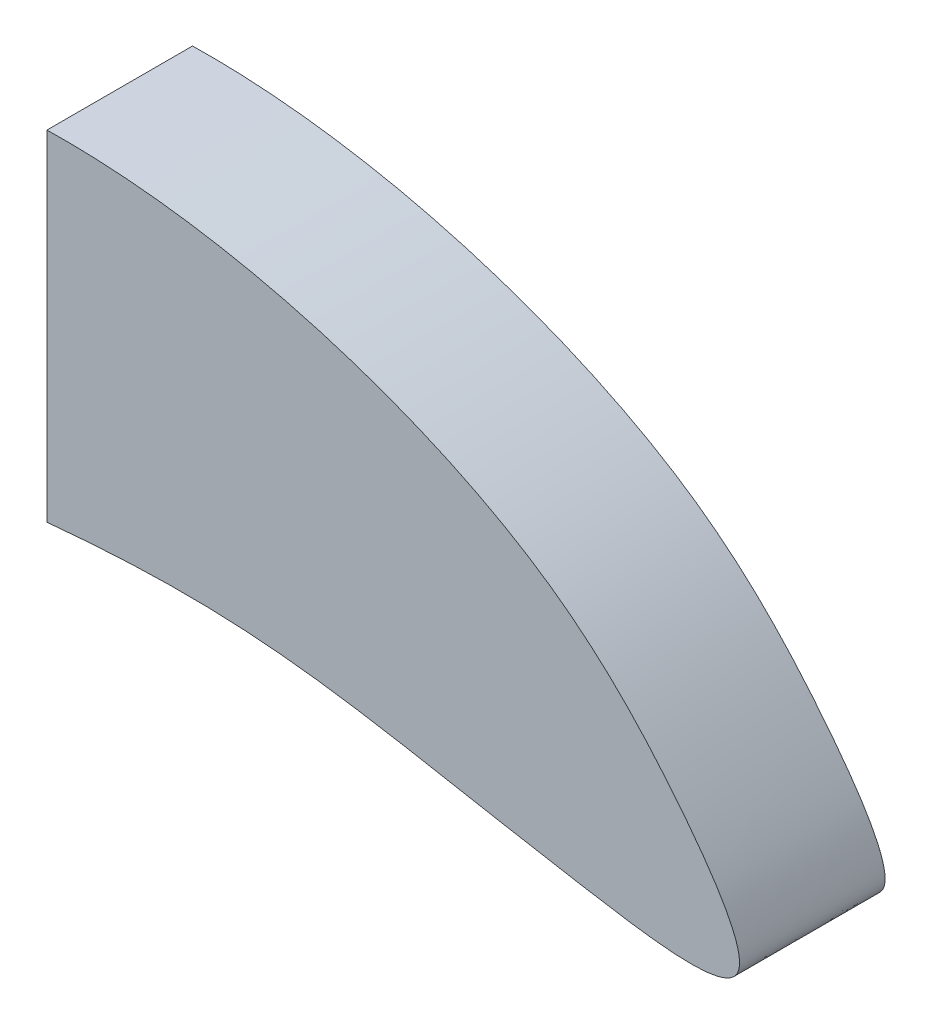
ISO-10303-21;
HEADER;
FILE_DESCRIPTION(('STEP AP214'),'2;1');
FILE_NAME('part.step','',(''),(''),'','','');
FILE_SCHEMA(('AUTOMOTIVE_DESIGN { 1 0 10303 214 1 1 1 1 }'));
ENDSEC;
DATA;
#1=APPLICATION_CONTEXT('core data for automotive mechanical design processes');
#2=APPLICATION_PROTOCOL_DEFINITION('international standard','automotive_design',2000,#1);
#3=PRODUCT_CONTEXT('',#1,'mechanical');
#4=PRODUCT('Part','Part','',(#3));
#5=PRODUCT_RELATED_PRODUCT_CATEGORY('part','',(#4));
#6=PRODUCT_DEFINITION_FORMATION('','',#4);
#7=PRODUCT_DEFINITION_CONTEXT('part definition',#1,'design');
#8=PRODUCT_DEFINITION('design','',#6,#7);
#9=PRODUCT_DEFINITION_SHAPE('','',#8);
#10=(LENGTH_UNIT() NAMED_UNIT(*) SI_UNIT(.MILLI.,.METRE.));
#11=(NAMED_UNIT(*) PLANE_ANGLE_UNIT() SI_UNIT($,.RADIAN.));
#12=(NAMED_UNIT(*) SI_UNIT($,.STERADIAN.) SOLID_ANGLE_UNIT());
#13=UNCERTAINTY_MEASURE_WITH_UNIT(LENGTH_MEASURE(1.E-05),#10,'distance_accuracy_value','');
#14=(GEOMETRIC_REPRESENTATION_CONTEXT(3) GLOBAL_UNCERTAINTY_ASSIGNED_CONTEXT((#13)) GLOBAL_UNIT_ASSIGNED_CONTEXT((#10,
#11,#12)) REPRESENTATION_CONTEXT('',''));
#15=CARTESIAN_POINT('',(0.,0.,0.));
#16=DIRECTION('',(0.,0.,1.));
#17=DIRECTION('',(1.,0.,0.));
#18=AXIS2_PLACEMENT_3D('',#15,#16,#17);
#19=CARTESIAN_POINT('',(0.,0.,6.));
#20=CARTESIAN_POINT('',(9.57446563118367,0.910116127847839,6.));
#21=CARTESIAN_POINT('',(13.9301025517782,-0.801041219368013,6.));
#22=CARTESIAN_POINT('',(30.4927181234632,-3.24660980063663,6.));
#23=CARTESIAN_POINT('',(24.8297074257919,4.98536491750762,6.));
#24=CARTESIAN_POINT('',(17.1941657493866,11.3977257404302,6.));
#25=CARTESIAN_POINT('',(6.34164344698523,14.1314431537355,6.));
#26=CARTESIAN_POINT('',(0.,14.,6.));
#27=B_SPLINE_CURVE_WITH_KNOTS('',3,(#19,#20,#21,#22,#23,#24,#25,#26),.UNSPECIFIED.,.F.,.F.,(4,1,
1,1,1,4),(0.,0.362149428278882,0.453308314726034,0.535340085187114,0.689620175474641,1.),.UNSPECIFIED.);
#28=DIRECTION('',(0.,0.,-1.));
#29=VECTOR('',#28,1.);
#30=SURFACE_OF_LINEAR_EXTRUSION('',#27,#29);
#31=CARTESIAN_POINT('',(0.,0.,0.));
#32=CARTESIAN_POINT('',(9.57446563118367,0.910116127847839,0.));
#33=CARTESIAN_POINT('',(13.9301025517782,-0.801041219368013,0.));
#34=CARTESIAN_POINT('',(30.4927181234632,-3.24660980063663,0.));
#35=CARTESIAN_POINT('',(24.8297074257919,4.98536491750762,0.));
#36=CARTESIAN_POINT('',(17.1941657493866,11.3977257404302,0.));
#37=CARTESIAN_POINT('',(6.34164344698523,14.1314431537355,0.));
#38=CARTESIAN_POINT('',(0.,14.,0.));
#39=B_SPLINE_CURVE_WITH_KNOTS('',3,(#31,#32,#33,#34,#35,#36,#37,#38),.UNSPECIFIED.,.F.,.F.,(4,1,
1,1,1,4),(0.,0.362149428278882,0.453308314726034,0.535340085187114,0.689620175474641,1.),.UNSPECIFIED.);
#40=CARTESIAN_POINT('',(0.,0.,0.));
#41=VERTEX_POINT('',#40);
#42=CARTESIAN_POINT('',(0.,14.,0.));
#43=VERTEX_POINT('',#42);
#44=EDGE_CURVE('E73',#41,#43,#39,.T.);
#45=ORIENTED_EDGE('',*,*,#44,.T.);
#46=DIRECTION('',(0.,0.,-1.));
#47=VECTOR('',#46,1.);
#48=CARTESIAN_POINT('',(0.,14.,6.));
#49=LINE('',#48,#47);
#50=CARTESIAN_POINT('',(0.,14.,6.));
#51=VERTEX_POINT('',#50);
#52=EDGE_CURVE('E11',#51,#43,#49,.T.);
#53=ORIENTED_EDGE('',*,*,#52,.F.);
#54=CARTESIAN_POINT('',(0.,0.,6.));
#55=VERTEX_POINT('',#54);
#56=EDGE_CURVE('E72',#55,#51,#27,.T.);
#57=ORIENTED_EDGE('',*,*,#56,.F.);
#58=DIRECTION('',(0.,0.,-1.));
#59=VECTOR('',#58,1.);
#60=CARTESIAN_POINT('',(0.,0.,6.));
#61=LINE('',#60,#59);
#62=EDGE_CURVE('E50',#55,#41,#61,.T.);
#63=ORIENTED_EDGE('',*,*,#62,.T.);
#64=EDGE_LOOP('',(#45,#53,#57,#63));
#65=FACE_BOUND('',#64,.T.);
#66=ADVANCED_FACE('F41',(#65),#30,.F.);
#67=CARTESIAN_POINT('',(0.,0.,6.));
#68=DIRECTION('',(1.,0.,0.));
#69=DIRECTION('',(0.,0.,-1.));
#70=AXIS2_PLACEMENT_3D('',#67,#68,#69);
#71=PLANE('',#70);
#72=DIRECTION('',(0.,-1.,0.));
#73=VECTOR('',#72,1.);
#74=CARTESIAN_POINT('',(0.,0.,0.));
#75=LINE('',#74,#73);
#76=EDGE_CURVE('E65',#43,#41,#75,.T.);
#77=ORIENTED_EDGE('',*,*,#76,.T.);
#78=ORIENTED_EDGE('',*,*,#62,.F.);
#79=DIRECTION('',(0.,-1.,0.));
#80=VECTOR('',#79,1.);
#81=CARTESIAN_POINT('',(0.,0.,6.));
#82=LINE('',#81,#80);
#83=EDGE_CURVE('E57',#51,#55,#82,.T.);
#84=ORIENTED_EDGE('',*,*,#83,.F.);
#85=ORIENTED_EDGE('',*,*,#52,.T.);
#86=EDGE_LOOP('',(#77,#78,#84,#85));
#87=FACE_BOUND('',#86,.T.);
#88=ADVANCED_FACE('F68',(#87),#71,.F.);
#89=CARTESIAN_POINT('',(27.7801648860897,0.525918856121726,6.));
#90=DIRECTION('',(0.,0.,1.));
#91=DIRECTION('',(1.,0.,0.));
#92=AXIS2_PLACEMENT_3D('',#89,#90,#91);
#93=PLANE('',#92);
#94=ORIENTED_EDGE('',*,*,#56,.T.);
#95=ORIENTED_EDGE('',*,*,#83,.T.);
#96=EDGE_LOOP('',(#94,#95));
#97=FACE_BOUND('',#96,.T.);
#98=ADVANCED_FACE('F90',(#97),#93,.T.);
#99=CARTESIAN_POINT('',(27.7801648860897,0.525918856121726,0.));
#100=DIRECTION('',(0.,0.,1.));
#101=DIRECTION('',(1.,0.,0.));
#102=AXIS2_PLACEMENT_3D('',#99,#100,#101);
#103=PLANE('',#102);
#104=ORIENTED_EDGE('',*,*,#44,.F.);
#105=ORIENTED_EDGE('',*,*,#76,.F.);
#106=EDGE_LOOP('',(#104,#105));
#107=FACE_BOUND('',#106,.T.);
#108=ADVANCED_FACE('F76',(#107),#103,.F.);
#109=CLOSED_SHELL('',(#66,#88,#98,#108));
#110=MANIFOLD_SOLID_BREP('B2',#109);
#111=ADVANCED_BREP_SHAPE_REPRESENTATION('',(#18,#110),#14);
#112=SHAPE_DEFINITION_REPRESENTATION(#9,#111);
ENDSEC;
END-ISO-10303-21;
